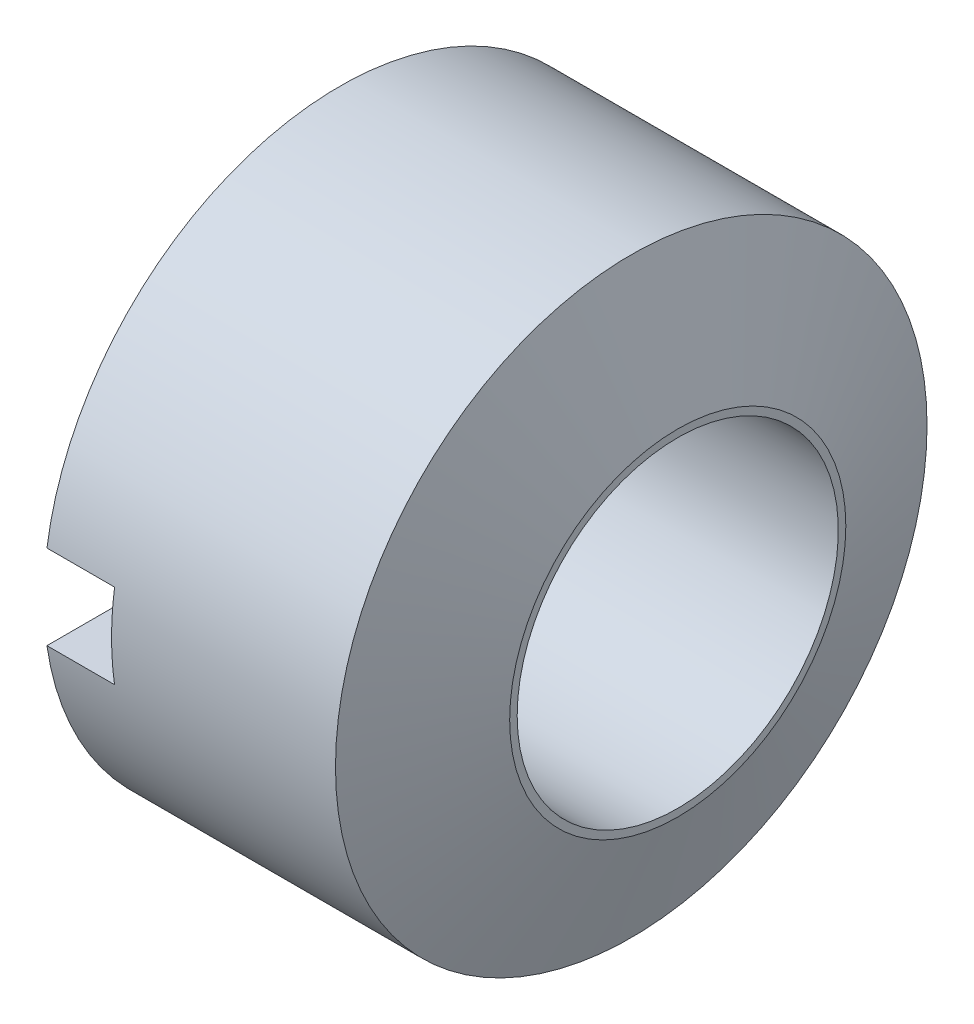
from build123d import *

# Parameters (mm, degrees)
SKIZZE4_W               = 0.8
SKIZZE4_H               = 1
LINEAR_AUSTRAGEN1_DEPTH = 20


with BuildPart() as part:
    # Skizze1 → Rotation1 (revolve)
    with BuildSketch(Plane.XY, mode=Mode.PRIVATE) as rotation1_sk:
        Polygon((13.849369, 1.9), (13.849369, 1.988887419), (13.299369, 3.5), (9.849369, 3.5), (9.849369, 1.9), align=None)
    revolve(rotation1_sk.sketch.rotate(Axis((0, 0, 0), (1, 0, 0)), 90), axis=Axis((0, 0, 0), (1, 0, 0)))

    # Skizze4 → Linear austragen1 (cut, symmetric)
    with BuildSketch(Plane.XY):
        with Locations((10.249369, 0)):
            Rectangle(SKIZZE4_W, SKIZZE4_H)
    extrude(amount=LINEAR_AUSTRAGEN1_DEPTH, both=True, mode=Mode.SUBTRACT)


solid = part.part
